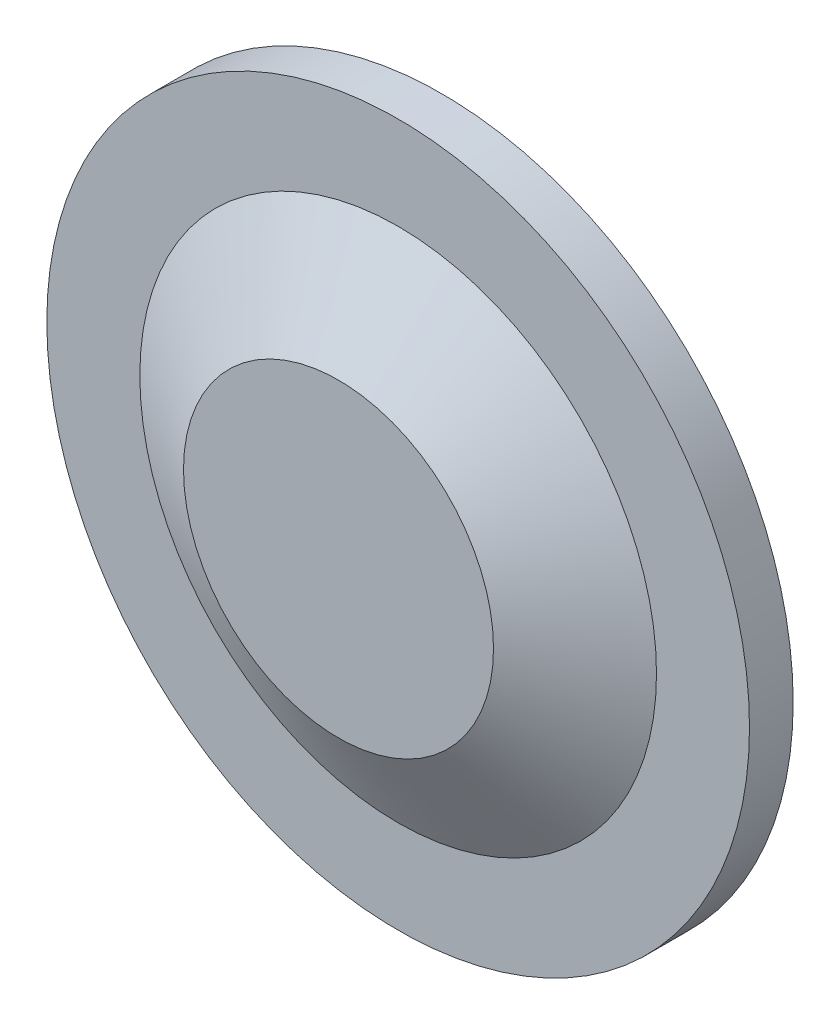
ISO-10303-21;
HEADER;
FILE_DESCRIPTION(('STEP AP214'),'2;1');
FILE_NAME('part.step','',(''),(''),'','','');
FILE_SCHEMA(('AUTOMOTIVE_DESIGN { 1 0 10303 214 1 1 1 1 }'));
ENDSEC;
DATA;
#1=APPLICATION_CONTEXT('core data for automotive mechanical design processes');
#2=APPLICATION_PROTOCOL_DEFINITION('international standard','automotive_design',2000,#1);
#3=PRODUCT_CONTEXT('',#1,'mechanical');
#4=PRODUCT('Part','Part','',(#3));
#5=PRODUCT_RELATED_PRODUCT_CATEGORY('part','',(#4));
#6=PRODUCT_DEFINITION_FORMATION('','',#4);
#7=PRODUCT_DEFINITION_CONTEXT('part definition',#1,'design');
#8=PRODUCT_DEFINITION('design','',#6,#7);
#9=PRODUCT_DEFINITION_SHAPE('','',#8);
#10=(LENGTH_UNIT() NAMED_UNIT(*) SI_UNIT(.MILLI.,.METRE.));
#11=(NAMED_UNIT(*) PLANE_ANGLE_UNIT() SI_UNIT($,.RADIAN.));
#12=(NAMED_UNIT(*) SI_UNIT($,.STERADIAN.) SOLID_ANGLE_UNIT());
#13=UNCERTAINTY_MEASURE_WITH_UNIT(LENGTH_MEASURE(1.E-05),#10,'distance_accuracy_value','');
#14=(GEOMETRIC_REPRESENTATION_CONTEXT(3) GLOBAL_UNCERTAINTY_ASSIGNED_CONTEXT((#13)) GLOBAL_UNIT_ASSIGNED_CONTEXT((#10,
#11,#12)) REPRESENTATION_CONTEXT('',''));
#15=CARTESIAN_POINT('',(0.,0.,0.));
#16=DIRECTION('',(0.,0.,1.));
#17=DIRECTION('',(1.,0.,0.));
#18=AXIS2_PLACEMENT_3D('',#15,#16,#17);
#19=CARTESIAN_POINT('',(0.,0.,0.));
#20=DIRECTION('',(0.,0.,1.));
#21=DIRECTION('',(1.,0.,0.));
#22=AXIS2_PLACEMENT_3D('',#19,#20,#21);
#23=PLANE('',#22);
#24=CARTESIAN_POINT('',(0.,0.,0.));
#25=DIRECTION('',(0.,0.,-1.));
#26=DIRECTION('',(-1.,0.,0.));
#27=AXIS2_PLACEMENT_3D('',#24,#25,#26);
#28=CIRCLE('',#27,850.);
#29=CARTESIAN_POINT('',(-850.,0.,0.));
#30=VERTEX_POINT('',#29);
#31=EDGE_CURVE('E12',#30,#30,#28,.T.);
#32=ORIENTED_EDGE('',*,*,#31,.T.);
#33=EDGE_LOOP('',(#32));
#34=FACE_BOUND('',#33,.T.);
#35=ADVANCED_FACE('F47',(#34),#23,.F.);
#36=CARTESIAN_POINT('',(0.,0.,0.));
#37=DIRECTION('',(0.,0.,-1.));
#38=DIRECTION('',(-1.,0.,0.));
#39=AXIS2_PLACEMENT_3D('',#36,#37,#38);
#40=CYLINDRICAL_SURFACE('',#39,850.);
#41=ORIENTED_EDGE('',*,*,#31,.F.);
#42=EDGE_LOOP('',(#41));
#43=FACE_BOUND('',#42,.T.);
#44=CARTESIAN_POINT('',(0.,0.,105.662432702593));
#45=DIRECTION('',(0.,0.,-1.));
#46=DIRECTION('',(-1.,0.,0.));
#47=AXIS2_PLACEMENT_3D('',#44,#45,#46);
#48=CIRCLE('',#47,850.);
#49=CARTESIAN_POINT('',(-850.,0.,105.662432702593));
#50=VERTEX_POINT('',#49);
#51=EDGE_CURVE('E54',#50,#50,#48,.T.);
#52=ORIENTED_EDGE('',*,*,#51,.T.);
#53=EDGE_LOOP('',(#52));
#54=FACE_BOUND('',#53,.T.);
#55=ADVANCED_FACE('F83',(#43,#54),#40,.T.);
#56=CARTESIAN_POINT('',(850.,0.,105.662432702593));
#57=DIRECTION('',(0.,0.,-1.));
#58=DIRECTION('',(-1.,0.,0.));
#59=AXIS2_PLACEMENT_3D('',#56,#57,#58);
#60=PLANE('',#59);
#61=ORIENTED_EDGE('',*,*,#51,.F.);
#62=EDGE_LOOP('',(#61));
#63=FACE_BOUND('',#62,.T.);
#64=CARTESIAN_POINT('',(0.,0.,105.662432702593));
#65=DIRECTION('',(0.,0.,-1.));
#66=DIRECTION('',(-1.,0.,0.));
#67=AXIS2_PLACEMENT_3D('',#64,#65,#66);
#68=CIRCLE('',#67,625.);
#69=CARTESIAN_POINT('',(-625.,0.,105.662432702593));
#70=VERTEX_POINT('',#69);
#71=EDGE_CURVE('E59',#70,#70,#68,.T.);
#72=ORIENTED_EDGE('',*,*,#71,.T.);
#73=EDGE_LOOP('',(#72));
#74=FACE_BOUND('',#73,.T.);
#75=ADVANCED_FACE('F79',(#63,#74),#60,.F.);
#76=CARTESIAN_POINT('',(0.,0.,250.));
#77=DIRECTION('',(0.,0.,-1.));
#78=DIRECTION('',(-1.,0.,0.));
#79=AXIS2_PLACEMENT_3D('',#76,#77,#78);
#80=CONICAL_SURFACE('',#79,375.,1.0471975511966);
#81=ORIENTED_EDGE('',*,*,#71,.F.);
#82=EDGE_LOOP('',(#81));
#83=FACE_BOUND('',#82,.T.);
#84=CARTESIAN_POINT('',(0.,0.,250.));
#85=DIRECTION('',(0.,0.,-1.));
#86=DIRECTION('',(-1.,0.,0.));
#87=AXIS2_PLACEMENT_3D('',#84,#85,#86);
#88=CIRCLE('',#87,375.);
#89=CARTESIAN_POINT('',(-375.,0.,250.));
#90=VERTEX_POINT('',#89);
#91=EDGE_CURVE('E64',#90,#90,#88,.T.);
#92=ORIENTED_EDGE('',*,*,#91,.T.);
#93=EDGE_LOOP('',(#92));
#94=FACE_BOUND('',#93,.T.);
#95=ADVANCED_FACE('F71',(#83,#94),#80,.T.);
#96=CARTESIAN_POINT('',(375.,0.,250.));
#97=DIRECTION('',(0.,0.,-1.));
#98=DIRECTION('',(-1.,0.,0.));
#99=AXIS2_PLACEMENT_3D('',#96,#97,#98);
#100=PLANE('',#99);
#101=ORIENTED_EDGE('',*,*,#91,.F.);
#102=EDGE_LOOP('',(#101));
#103=FACE_BOUND('',#102,.T.);
#104=ADVANCED_FACE('F73',(#103),#100,.F.);
#105=CLOSED_SHELL('',(#35,#55,#75,#95,#104));
#106=MANIFOLD_SOLID_BREP('B2',#105);
#107=ADVANCED_BREP_SHAPE_REPRESENTATION('',(#18,#106),#14);
#108=SHAPE_DEFINITION_REPRESENTATION(#9,#107);
ENDSEC;
END-ISO-10303-21;
